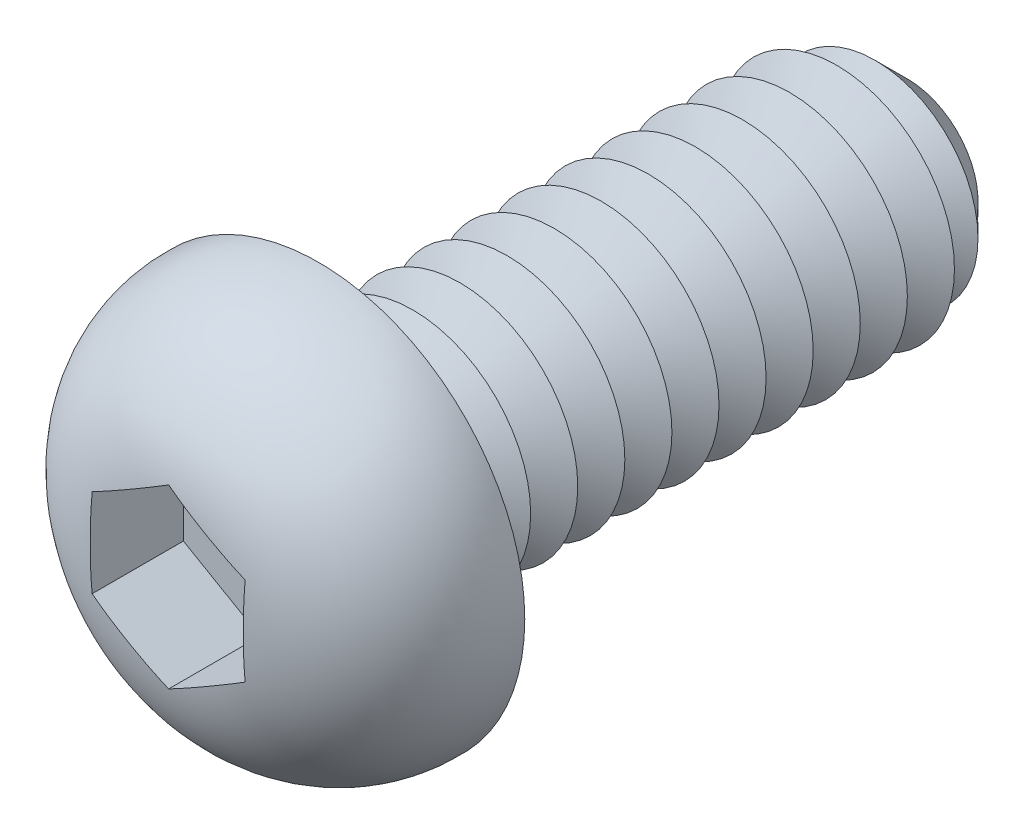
from build123d import *

# Parameters (mm, degrees)
CUT_EXTRUDE1_DEPTH  = 0.8
SKETCH4_R           = 1
BOSS_EXTRUDE1_DEPTH = 5
CHAMFER1_SIZE       = 0.4
LPATTERN1_COUNT     = 11
LPATTERN1_PITCH     = 0.4
FILLET2_R           = 0.2
SKETCH6_R           = 0.35
CUT_EXTRUDE2_DEPTH  = 5.5


with BuildPart() as part:
    # Sketch2 → Revolve1 (revolve)
    with BuildSketch(Plane(origin=(0, 0, 0), x_dir=(0, 0, -1), z_dir=(1, 0, 0)), mode=Mode.PRIVATE) as revolve1_sk:
        with BuildLine():
            Line((0, 0), (-1.3, 0))
            Line((-1.3, 0), (-1.3, 0.5010004))
            ThreePointArc((-1.3, 0.5010004), (-0.916025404, 1.402388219), (0, 1.75))
            Line((0, 1.75), (0, 0))
        make_face()
    revolve(revolve1_sk.sketch.rotate(Axis((0, 0, 47.934239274), (0, 0, -1)), 90), axis=Axis((0, 0, 47.934239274), (0, 0, -1)))

    # Sketch3 → Cut-Extrude1 (cut)
    with BuildSketch(Plane.XY.offset(1.3)):
        Polygon((0, 0.75055535), (-0.65, 0.375277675), (-0.65, -0.375277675), (0, -0.75055535), (0.65, -0.375277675), (0.65, 0.375277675), align=None)
    extrude(amount=-CUT_EXTRUDE1_DEPTH, mode=Mode.SUBTRACT)

    # Sketch4 → Boss-Extrude1 (add)
    with BuildSketch(Plane(origin=(0, 0, 0), x_dir=(-1, 0, 0), z_dir=(0, 0, -1))):
        Circle(SKETCH4_R)
    extrude(amount=BOSS_EXTRUDE1_DEPTH)

    # Chamfer1
    chamfer1_edges = [part.edges().sort_by_distance(p)[0] for p in [
        (1, 0, -5),
    ]]
    chamfer(chamfer1_edges, length=CHAMFER1_SIZE)

    # Sketch5 → Cut-Revolve1 (revolve, cut)
    with BuildSketch(Plane(origin=(0, 0, 0), x_dir=(0, 0, -1), z_dir=(1, 0, 0)), mode=Mode.PRIVATE) as cut_revolve1_sk:
        Polygon((0.4, 1), (0.8, 1), (0.6, 0.653589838), align=None)
    cut_revolve1 = revolve(cut_revolve1_sk.sketch.rotate(Axis((0, 0, 47.934239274), (0, 0, -1)), 90), axis=Axis((0, 0, 47.934239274), (0, 0, -1)), mode=Mode.SUBTRACT)

    # LPattern1: Cut-Revolve1 ×11
    with Locations(*[(0, 0, -i * LPATTERN1_PITCH) for i in range(1, LPATTERN1_COUNT)]):
        add(cut_revolve1, mode=Mode.SUBTRACT)

    # Fillet2
    fillet2_edges = [part.edges().sort_by_distance(p)[0] for p in [
        (1, 0, 0),
    ]]
    fillet(fillet2_edges, radius=FILLET2_R)

    # Sketch6 → Cut-Extrude2 (cut)
    with BuildSketch(Plane.XY.offset(0.5)):
        Circle(SKETCH6_R)
    extrude(amount=-CUT_EXTRUDE2_DEPTH, mode=Mode.SUBTRACT)


solid = part.part
